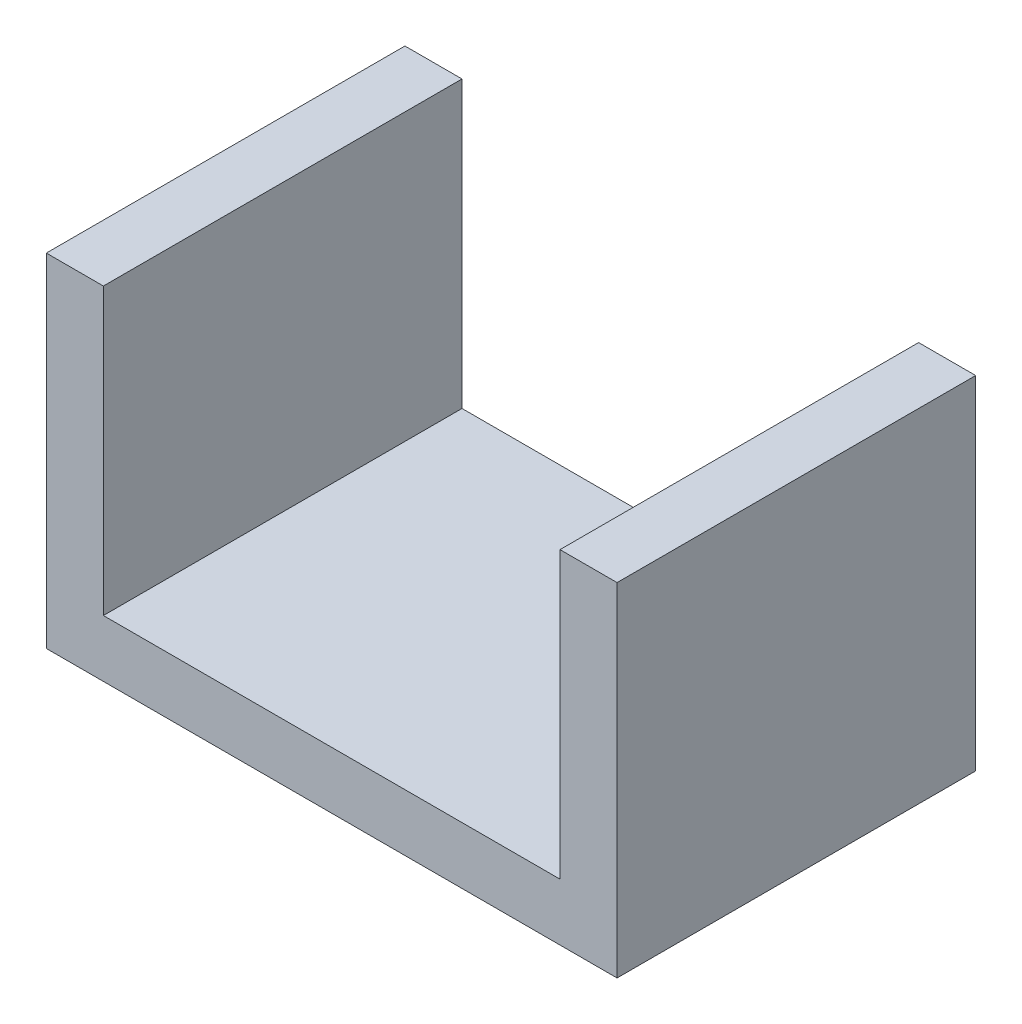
ISO-10303-21;
HEADER;
FILE_DESCRIPTION(('STEP AP214'),'2;1');
FILE_NAME('part.step','',(''),(''),'','','');
FILE_SCHEMA(('AUTOMOTIVE_DESIGN { 1 0 10303 214 1 1 1 1 }'));
ENDSEC;
DATA;
#1=APPLICATION_CONTEXT('core data for automotive mechanical design processes');
#2=APPLICATION_PROTOCOL_DEFINITION('international standard','automotive_design',2000,#1);
#3=PRODUCT_CONTEXT('',#1,'mechanical');
#4=PRODUCT('Part','Part','',(#3));
#5=PRODUCT_RELATED_PRODUCT_CATEGORY('part','',(#4));
#6=PRODUCT_DEFINITION_FORMATION('','',#4);
#7=PRODUCT_DEFINITION_CONTEXT('part definition',#1,'design');
#8=PRODUCT_DEFINITION('design','',#6,#7);
#9=PRODUCT_DEFINITION_SHAPE('','',#8);
#10=(LENGTH_UNIT() NAMED_UNIT(*) SI_UNIT(.MILLI.,.METRE.));
#11=(NAMED_UNIT(*) PLANE_ANGLE_UNIT() SI_UNIT($,.RADIAN.));
#12=(NAMED_UNIT(*) SI_UNIT($,.STERADIAN.) SOLID_ANGLE_UNIT());
#13=UNCERTAINTY_MEASURE_WITH_UNIT(LENGTH_MEASURE(1.E-05),#10,'distance_accuracy_value','');
#14=(GEOMETRIC_REPRESENTATION_CONTEXT(3) GLOBAL_UNCERTAINTY_ASSIGNED_CONTEXT((#13)) GLOBAL_UNIT_ASSIGNED_CONTEXT((#10,
#11,#12)) REPRESENTATION_CONTEXT('',''));
#15=CARTESIAN_POINT('',(0.,0.,0.));
#16=DIRECTION('',(0.,0.,1.));
#17=DIRECTION('',(1.,0.,0.));
#18=AXIS2_PLACEMENT_3D('',#15,#16,#17);
#19=CARTESIAN_POINT('',(-50.,60.,31.4172495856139));
#20=DIRECTION('',(0.,-1.,0.));
#21=DIRECTION('',(0.,0.,-1.));
#22=AXIS2_PLACEMENT_3D('',#19,#20,#21);
#23=PLANE('',#22);
#24=DIRECTION('',(-1.,0.,0.));
#25=VECTOR('',#24,1.);
#26=CARTESIAN_POINT('',(-50.,60.,-31.4172495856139));
#27=LINE('',#26,#25);
#28=CARTESIAN_POINT('',(-40.,60.,-31.4172495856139));
#29=VERTEX_POINT('',#28);
#30=CARTESIAN_POINT('',(-50.,60.,-31.4172495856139));
#31=VERTEX_POINT('',#30);
#32=EDGE_CURVE('E100',#29,#31,#27,.T.);
#33=ORIENTED_EDGE('',*,*,#32,.T.);
#34=DIRECTION('',(0.,0.,-1.));
#35=VECTOR('',#34,1.);
#36=CARTESIAN_POINT('',(-50.,60.,31.4172495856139));
#37=LINE('',#36,#35);
#38=CARTESIAN_POINT('',(-50.,60.,31.4172495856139));
#39=VERTEX_POINT('',#38);
#40=EDGE_CURVE('E11',#39,#31,#37,.T.);
#41=ORIENTED_EDGE('',*,*,#40,.F.);
#42=DIRECTION('',(-1.,0.,0.));
#43=VECTOR('',#42,1.);
#44=CARTESIAN_POINT('',(-50.,60.,31.4172495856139));
#45=LINE('',#44,#43);
#46=CARTESIAN_POINT('',(-40.,60.,31.4172495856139));
#47=VERTEX_POINT('',#46);
#48=EDGE_CURVE('E127',#47,#39,#45,.T.);
#49=ORIENTED_EDGE('',*,*,#48,.F.);
#50=DIRECTION('',(0.,0.,-1.));
#51=VECTOR('',#50,1.);
#52=CARTESIAN_POINT('',(-40.,60.,31.4172495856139));
#53=LINE('',#52,#51);
#54=EDGE_CURVE('E113',#47,#29,#53,.T.);
#55=ORIENTED_EDGE('',*,*,#54,.T.);
#56=EDGE_LOOP('',(#33,#41,#49,#55));
#57=FACE_BOUND('',#56,.T.);
#58=ADVANCED_FACE('F32',(#57),#23,.F.);
#59=CARTESIAN_POINT('',(-50.,60.,31.4172495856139));
#60=DIRECTION('',(1.,0.,0.));
#61=DIRECTION('',(0.,0.,-1.));
#62=AXIS2_PLACEMENT_3D('',#59,#60,#61);
#63=PLANE('',#62);
#64=DIRECTION('',(0.,-1.,0.));
#65=VECTOR('',#64,1.);
#66=CARTESIAN_POINT('',(-50.,60.,-31.4172495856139));
#67=LINE('',#66,#65);
#68=CARTESIAN_POINT('',(-50.,0.,-31.4172495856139));
#69=VERTEX_POINT('',#68);
#70=EDGE_CURVE('E96',#31,#69,#67,.T.);
#71=ORIENTED_EDGE('',*,*,#70,.T.);
#72=DIRECTION('',(0.,0.,-1.));
#73=VECTOR('',#72,1.);
#74=CARTESIAN_POINT('',(-50.,0.,31.4172495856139));
#75=LINE('',#74,#73);
#76=CARTESIAN_POINT('',(-50.,0.,31.4172495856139));
#77=VERTEX_POINT('',#76);
#78=EDGE_CURVE('E39',#77,#69,#75,.T.);
#79=ORIENTED_EDGE('',*,*,#78,.F.);
#80=DIRECTION('',(0.,-1.,0.));
#81=VECTOR('',#80,1.);
#82=CARTESIAN_POINT('',(-50.,60.,31.4172495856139));
#83=LINE('',#82,#81);
#84=EDGE_CURVE('E109',#39,#77,#83,.T.);
#85=ORIENTED_EDGE('',*,*,#84,.F.);
#86=ORIENTED_EDGE('',*,*,#40,.T.);
#87=EDGE_LOOP('',(#71,#79,#85,#86));
#88=FACE_BOUND('',#87,.T.);
#89=ADVANCED_FACE('F108',(#88),#63,.F.);
#90=CARTESIAN_POINT('',(-50.,0.,31.4172495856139));
#91=DIRECTION('',(0.,1.,0.));
#92=DIRECTION('',(0.,0.,1.));
#93=AXIS2_PLACEMENT_3D('',#90,#91,#92);
#94=PLANE('',#93);
#95=DIRECTION('',(1.,0.,0.));
#96=VECTOR('',#95,1.);
#97=CARTESIAN_POINT('',(-50.,0.,-31.4172495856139));
#98=LINE('',#97,#96);
#99=CARTESIAN_POINT('',(50.,0.,-31.4172495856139));
#100=VERTEX_POINT('',#99);
#101=EDGE_CURVE('E102',#69,#100,#98,.T.);
#102=ORIENTED_EDGE('',*,*,#101,.T.);
#103=DIRECTION('',(0.,0.,-1.));
#104=VECTOR('',#103,1.);
#105=CARTESIAN_POINT('',(50.,0.,31.4172495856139));
#106=LINE('',#105,#104);
#107=CARTESIAN_POINT('',(50.,0.,31.4172495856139));
#108=VERTEX_POINT('',#107);
#109=EDGE_CURVE('E153',#108,#100,#106,.T.);
#110=ORIENTED_EDGE('',*,*,#109,.F.);
#111=DIRECTION('',(1.,0.,0.));
#112=VECTOR('',#111,1.);
#113=CARTESIAN_POINT('',(-50.,0.,31.4172495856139));
#114=LINE('',#113,#112);
#115=EDGE_CURVE('E130',#77,#108,#114,.T.);
#116=ORIENTED_EDGE('',*,*,#115,.F.);
#117=ORIENTED_EDGE('',*,*,#78,.T.);
#118=EDGE_LOOP('',(#102,#110,#116,#117));
#119=FACE_BOUND('',#118,.T.);
#120=ADVANCED_FACE('F157',(#119),#94,.F.);
#121=CARTESIAN_POINT('',(50.,0.,31.4172495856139));
#122=DIRECTION('',(-1.,0.,0.));
#123=DIRECTION('',(0.,0.,1.));
#124=AXIS2_PLACEMENT_3D('',#121,#122,#123);
#125=PLANE('',#124);
#126=DIRECTION('',(0.,1.,0.));
#127=VECTOR('',#126,1.);
#128=CARTESIAN_POINT('',(50.,0.,-31.4172495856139));
#129=LINE('',#128,#127);
#130=CARTESIAN_POINT('',(50.,60.,-31.4172495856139));
#131=VERTEX_POINT('',#130);
#132=EDGE_CURVE('E117',#100,#131,#129,.T.);
#133=ORIENTED_EDGE('',*,*,#132,.T.);
#134=DIRECTION('',(0.,0.,-1.));
#135=VECTOR('',#134,1.);
#136=CARTESIAN_POINT('',(50.,60.,31.4172495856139));
#137=LINE('',#136,#135);
#138=CARTESIAN_POINT('',(50.,60.,31.4172495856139));
#139=VERTEX_POINT('',#138);
#140=EDGE_CURVE('E150',#139,#131,#137,.T.);
#141=ORIENTED_EDGE('',*,*,#140,.F.);
#142=DIRECTION('',(0.,1.,0.));
#143=VECTOR('',#142,1.);
#144=CARTESIAN_POINT('',(50.,0.,31.4172495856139));
#145=LINE('',#144,#143);
#146=EDGE_CURVE('E132',#108,#139,#145,.T.);
#147=ORIENTED_EDGE('',*,*,#146,.F.);
#148=ORIENTED_EDGE('',*,*,#109,.T.);
#149=EDGE_LOOP('',(#133,#141,#147,#148));
#150=FACE_BOUND('',#149,.T.);
#151=ADVANCED_FACE('F165',(#150),#125,.F.);
#152=CARTESIAN_POINT('',(40.,60.,31.4172495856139));
#153=DIRECTION('',(0.,-1.,0.));
#154=DIRECTION('',(0.,0.,-1.));
#155=AXIS2_PLACEMENT_3D('',#152,#153,#154);
#156=PLANE('',#155);
#157=DIRECTION('',(-1.,0.,0.));
#158=VECTOR('',#157,1.);
#159=CARTESIAN_POINT('',(40.,60.,-31.4172495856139));
#160=LINE('',#159,#158);
#161=CARTESIAN_POINT('',(40.,60.,-31.4172495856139));
#162=VERTEX_POINT('',#161);
#163=EDGE_CURVE('E119',#131,#162,#160,.T.);
#164=ORIENTED_EDGE('',*,*,#163,.T.);
#165=DIRECTION('',(0.,0.,-1.));
#166=VECTOR('',#165,1.);
#167=CARTESIAN_POINT('',(40.,60.,31.4172495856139));
#168=LINE('',#167,#166);
#169=CARTESIAN_POINT('',(40.,60.,31.4172495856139));
#170=VERTEX_POINT('',#169);
#171=EDGE_CURVE('E147',#170,#162,#168,.T.);
#172=ORIENTED_EDGE('',*,*,#171,.F.);
#173=DIRECTION('',(-1.,0.,0.));
#174=VECTOR('',#173,1.);
#175=CARTESIAN_POINT('',(40.,60.,31.4172495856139));
#176=LINE('',#175,#174);
#177=EDGE_CURVE('E134',#139,#170,#176,.T.);
#178=ORIENTED_EDGE('',*,*,#177,.F.);
#179=ORIENTED_EDGE('',*,*,#140,.T.);
#180=EDGE_LOOP('',(#164,#172,#178,#179));
#181=FACE_BOUND('',#180,.T.);
#182=ADVANCED_FACE('F168',(#181),#156,.F.);
#183=CARTESIAN_POINT('',(40.,10.,31.4172495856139));
#184=DIRECTION('',(1.,0.,0.));
#185=DIRECTION('',(0.,0.,-1.));
#186=AXIS2_PLACEMENT_3D('',#183,#184,#185);
#187=PLANE('',#186);
#188=DIRECTION('',(0.,-1.,0.));
#189=VECTOR('',#188,1.);
#190=CARTESIAN_POINT('',(40.,10.,-31.4172495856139));
#191=LINE('',#190,#189);
#192=CARTESIAN_POINT('',(40.,10.,-31.4172495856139));
#193=VERTEX_POINT('',#192);
#194=EDGE_CURVE('E121',#162,#193,#191,.T.);
#195=ORIENTED_EDGE('',*,*,#194,.T.);
#196=DIRECTION('',(0.,0.,-1.));
#197=VECTOR('',#196,1.);
#198=CARTESIAN_POINT('',(40.,10.,31.4172495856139));
#199=LINE('',#198,#197);
#200=CARTESIAN_POINT('',(40.,10.,31.4172495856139));
#201=VERTEX_POINT('',#200);
#202=EDGE_CURVE('E144',#201,#193,#199,.T.);
#203=ORIENTED_EDGE('',*,*,#202,.F.);
#204=DIRECTION('',(0.,-1.,0.));
#205=VECTOR('',#204,1.);
#206=CARTESIAN_POINT('',(40.,10.,31.4172495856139));
#207=LINE('',#206,#205);
#208=EDGE_CURVE('E136',#170,#201,#207,.T.);
#209=ORIENTED_EDGE('',*,*,#208,.F.);
#210=ORIENTED_EDGE('',*,*,#171,.T.);
#211=EDGE_LOOP('',(#195,#203,#209,#210));
#212=FACE_BOUND('',#211,.T.);
#213=ADVANCED_FACE('F173',(#212),#187,.F.);
#214=CARTESIAN_POINT('',(-40.,10.,31.4172495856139));
#215=DIRECTION('',(0.,-1.,0.));
#216=DIRECTION('',(0.,0.,-1.));
#217=AXIS2_PLACEMENT_3D('',#214,#215,#216);
#218=PLANE('',#217);
#219=DIRECTION('',(-1.,0.,0.));
#220=VECTOR('',#219,1.);
#221=CARTESIAN_POINT('',(-40.,10.,-31.4172495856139));
#222=LINE('',#221,#220);
#223=CARTESIAN_POINT('',(-40.,10.,-31.4172495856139));
#224=VERTEX_POINT('',#223);
#225=EDGE_CURVE('E123',#193,#224,#222,.T.);
#226=ORIENTED_EDGE('',*,*,#225,.T.);
#227=DIRECTION('',(0.,0.,-1.));
#228=VECTOR('',#227,1.);
#229=CARTESIAN_POINT('',(-40.,10.,31.4172495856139));
#230=LINE('',#229,#228);
#231=CARTESIAN_POINT('',(-40.,10.,31.4172495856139));
#232=VERTEX_POINT('',#231);
#233=EDGE_CURVE('E141',#232,#224,#230,.T.);
#234=ORIENTED_EDGE('',*,*,#233,.F.);
#235=DIRECTION('',(-1.,0.,0.));
#236=VECTOR('',#235,1.);
#237=CARTESIAN_POINT('',(-40.,10.,31.4172495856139));
#238=LINE('',#237,#236);
#239=EDGE_CURVE('E51',#201,#232,#238,.T.);
#240=ORIENTED_EDGE('',*,*,#239,.F.);
#241=ORIENTED_EDGE('',*,*,#202,.T.);
#242=EDGE_LOOP('',(#226,#234,#240,#241));
#243=FACE_BOUND('',#242,.T.);
#244=ADVANCED_FACE('F176',(#243),#218,.F.);
#245=CARTESIAN_POINT('',(-40.,60.,31.4172495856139));
#246=DIRECTION('',(-1.,0.,0.));
#247=DIRECTION('',(0.,-1.,0.));
#248=AXIS2_PLACEMENT_3D('',#245,#246,#247);
#249=PLANE('',#248);
#250=DIRECTION('',(0.,1.,0.));
#251=VECTOR('',#250,1.);
#252=CARTESIAN_POINT('',(-40.,60.,-31.4172495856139));
#253=LINE('',#252,#251);
#254=EDGE_CURVE('E125',#224,#29,#253,.T.);
#255=ORIENTED_EDGE('',*,*,#254,.T.);
#256=ORIENTED_EDGE('',*,*,#54,.F.);
#257=DIRECTION('',(0.,1.,0.));
#258=VECTOR('',#257,1.);
#259=CARTESIAN_POINT('',(-40.,60.,31.4172495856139));
#260=LINE('',#259,#258);
#261=EDGE_CURVE('E46',#232,#47,#260,.T.);
#262=ORIENTED_EDGE('',*,*,#261,.F.);
#263=ORIENTED_EDGE('',*,*,#233,.T.);
#264=EDGE_LOOP('',(#255,#256,#262,#263));
#265=FACE_BOUND('',#264,.T.);
#266=ADVANCED_FACE('F178',(#265),#249,.F.);
#267=CARTESIAN_POINT('',(40.,60.,31.4172495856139));
#268=DIRECTION('',(0.,0.,1.));
#269=DIRECTION('',(1.,0.,0.));
#270=AXIS2_PLACEMENT_3D('',#267,#268,#269);
#271=PLANE('',#270);
#272=ORIENTED_EDGE('',*,*,#48,.T.);
#273=ORIENTED_EDGE('',*,*,#84,.T.);
#274=ORIENTED_EDGE('',*,*,#115,.T.);
#275=ORIENTED_EDGE('',*,*,#146,.T.);
#276=ORIENTED_EDGE('',*,*,#177,.T.);
#277=ORIENTED_EDGE('',*,*,#208,.T.);
#278=ORIENTED_EDGE('',*,*,#239,.T.);
#279=ORIENTED_EDGE('',*,*,#261,.T.);
#280=EDGE_LOOP('',(#272,#273,#274,#275,#276,#277,#278,#279));
#281=FACE_BOUND('',#280,.T.);
#282=ADVANCED_FACE('F160',(#281),#271,.T.);
#283=CARTESIAN_POINT('',(40.,60.,-31.4172495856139));
#284=DIRECTION('',(0.,0.,1.));
#285=DIRECTION('',(1.,0.,0.));
#286=AXIS2_PLACEMENT_3D('',#283,#284,#285);
#287=PLANE('',#286);
#288=ORIENTED_EDGE('',*,*,#32,.F.);
#289=ORIENTED_EDGE('',*,*,#254,.F.);
#290=ORIENTED_EDGE('',*,*,#225,.F.);
#291=ORIENTED_EDGE('',*,*,#194,.F.);
#292=ORIENTED_EDGE('',*,*,#163,.F.);
#293=ORIENTED_EDGE('',*,*,#132,.F.);
#294=ORIENTED_EDGE('',*,*,#101,.F.);
#295=ORIENTED_EDGE('',*,*,#70,.F.);
#296=EDGE_LOOP('',(#288,#289,#290,#291,#292,#293,#294,#295));
#297=FACE_BOUND('',#296,.T.);
#298=ADVANCED_FACE('F97',(#297),#287,.F.);
#299=CLOSED_SHELL('',(#58,#89,#120,#151,#182,#213,#244,#266,#282,#298));
#300=MANIFOLD_SOLID_BREP('B2',#299);
#301=ADVANCED_BREP_SHAPE_REPRESENTATION('',(#18,#300),#14);
#302=SHAPE_DEFINITION_REPRESENTATION(#9,#301);
ENDSEC;
END-ISO-10303-21;
